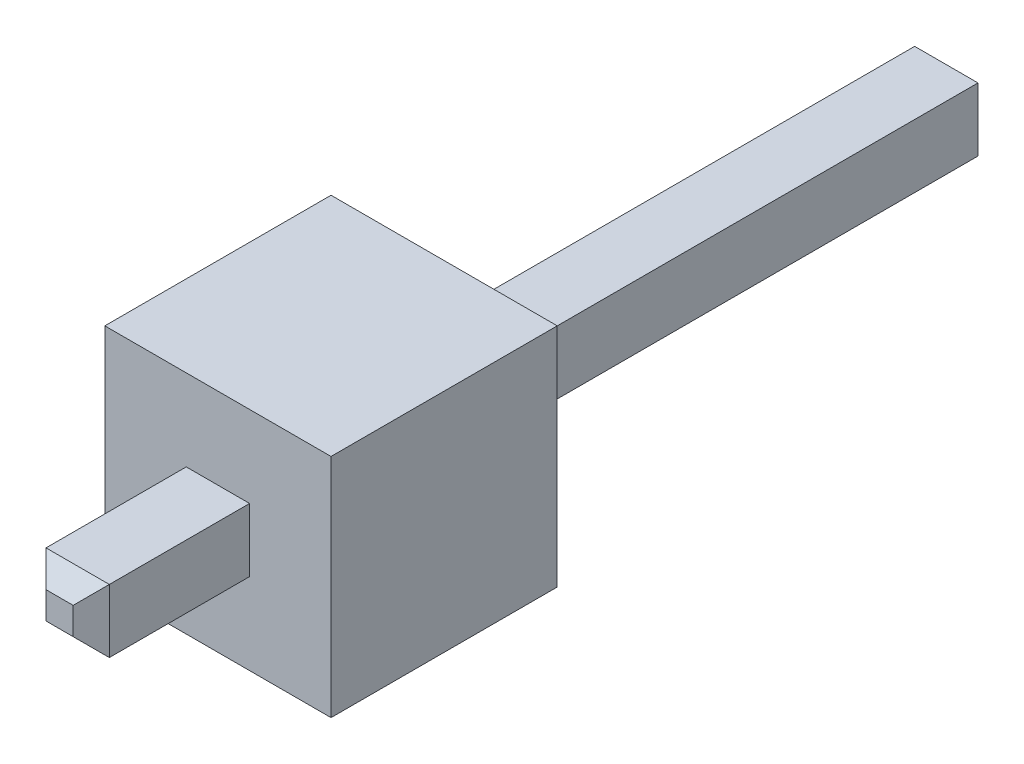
from build123d import *

# Parameters (mm, degrees)
SKETCH1_W           = 0.7112
SKETCH1_H           = 0.7112
BOSS_EXTRUDE1_DEPTH = 10.16
SKETCH5_W           = 2.54
SKETCH5_H           = 2.54
BOSS_EXTRUDE4_DEPTH = 2.54
CHAMFER1_SIZE       = 0.2032


with BuildPart() as part:
    # Sketch1 → Boss-Extrude1 (new body)
    with BuildSketch(Plane.XY):
        Rectangle(SKETCH1_W, SKETCH1_H)
    extrude(amount=BOSS_EXTRUDE1_DEPTH)

    # Sketch5 → Boss-Extrude4 (add)
    with BuildSketch(Plane(origin=(0, 0, 5.842), x_dir=(-1, 0, 0), z_dir=(0, 0, -1))):
        Rectangle(SKETCH5_W, SKETCH5_H)
    extrude(amount=-BOSS_EXTRUDE4_DEPTH)

    # Chamfer1
    chamfer1_edges = [part.edges().sort_by_distance(p)[0] for p in [
        (-0.3556, 0, 10.16),
        (0, -0.3556, 10.16),
        (0.3556, 0, 10.16),
        (0, -0.3556, 0),
        (-0.3556, 0, 0),
        (0, 0.3556, 0),
        (0.3556, 0, 0),
        (0, 0.3556, 10.16),
    ]]
    chamfer(chamfer1_edges, length=CHAMFER1_SIZE)


solid = part.part
